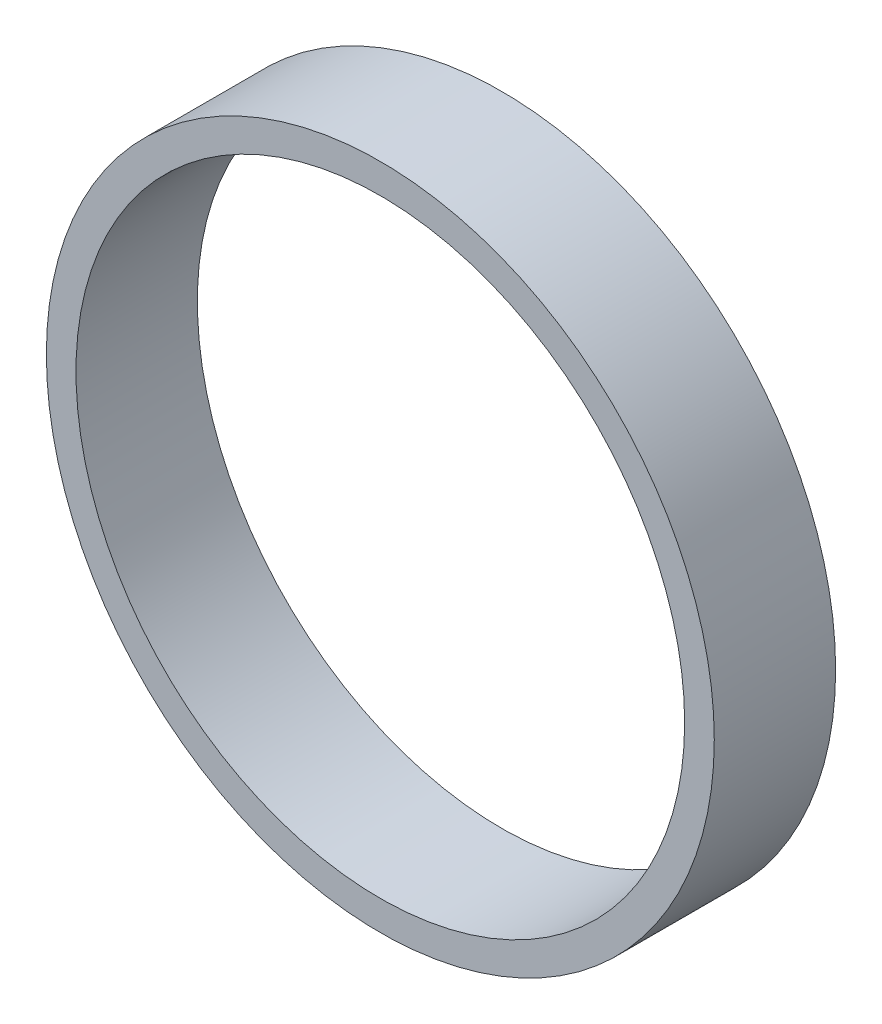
ISO-10303-21;
HEADER;
FILE_DESCRIPTION(('STEP AP214'),'2;1');
FILE_NAME('part.step','',(''),(''),'','','');
FILE_SCHEMA(('AUTOMOTIVE_DESIGN { 1 0 10303 214 1 1 1 1 }'));
ENDSEC;
DATA;
#1=APPLICATION_CONTEXT('core data for automotive mechanical design processes');
#2=APPLICATION_PROTOCOL_DEFINITION('international standard','automotive_design',2000,#1);
#3=PRODUCT_CONTEXT('',#1,'mechanical');
#4=PRODUCT('Part','Part','',(#3));
#5=PRODUCT_RELATED_PRODUCT_CATEGORY('part','',(#4));
#6=PRODUCT_DEFINITION_FORMATION('','',#4);
#7=PRODUCT_DEFINITION_CONTEXT('part definition',#1,'design');
#8=PRODUCT_DEFINITION('design','',#6,#7);
#9=PRODUCT_DEFINITION_SHAPE('','',#8);
#10=(LENGTH_UNIT() NAMED_UNIT(*) SI_UNIT(.MILLI.,.METRE.));
#11=(NAMED_UNIT(*) PLANE_ANGLE_UNIT() SI_UNIT($,.RADIAN.));
#12=(NAMED_UNIT(*) SI_UNIT($,.STERADIAN.) SOLID_ANGLE_UNIT());
#13=UNCERTAINTY_MEASURE_WITH_UNIT(LENGTH_MEASURE(1.E-05),#10,'distance_accuracy_value','');
#14=(GEOMETRIC_REPRESENTATION_CONTEXT(3) GLOBAL_UNCERTAINTY_ASSIGNED_CONTEXT((#13)) GLOBAL_UNIT_ASSIGNED_CONTEXT((#10,
#11,#12)) REPRESENTATION_CONTEXT('',''));
#15=CARTESIAN_POINT('',(0.,0.,0.));
#16=DIRECTION('',(0.,0.,1.));
#17=DIRECTION('',(1.,0.,0.));
#18=AXIS2_PLACEMENT_3D('',#15,#16,#17);
#19=CARTESIAN_POINT('',(0.,0.,12.7));
#20=DIRECTION('',(0.,0.,1.));
#21=DIRECTION('',(1.,0.,0.));
#22=AXIS2_PLACEMENT_3D('',#19,#20,#21);
#23=PLANE('',#22);
#24=CARTESIAN_POINT('',(0.,0.,12.7));
#25=DIRECTION('',(0.,0.,1.));
#26=DIRECTION('',(1.,0.,0.));
#27=AXIS2_PLACEMENT_3D('',#24,#25,#26);
#28=CIRCLE('',#27,34.95);
#29=CARTESIAN_POINT('',(34.95,0.,12.7));
#30=VERTEX_POINT('',#29);
#31=EDGE_CURVE('E8',#30,#30,#28,.T.);
#32=ORIENTED_EDGE('',*,*,#31,.T.);
#33=EDGE_LOOP('',(#32));
#34=FACE_BOUND('',#33,.T.);
#35=CARTESIAN_POINT('',(0.,0.,12.7));
#36=DIRECTION('',(0.,0.,1.));
#37=DIRECTION('',(1.,0.,0.));
#38=AXIS2_PLACEMENT_3D('',#35,#36,#37);
#39=CIRCLE('',#38,31.85);
#40=CARTESIAN_POINT('',(31.85,0.,12.7));
#41=VERTEX_POINT('',#40);
#42=EDGE_CURVE('E23',#41,#41,#39,.T.);
#43=ORIENTED_EDGE('',*,*,#42,.F.);
#44=EDGE_LOOP('',(#43));
#45=FACE_BOUND('',#44,.T.);
#46=ADVANCED_FACE('F12',(#34,#45),#23,.T.);
#47=CARTESIAN_POINT('',(0.,0.,0.));
#48=DIRECTION('',(0.,0.,1.));
#49=DIRECTION('',(1.,0.,0.));
#50=AXIS2_PLACEMENT_3D('',#47,#48,#49);
#51=PLANE('',#50);
#52=CARTESIAN_POINT('',(0.,0.,0.));
#53=DIRECTION('',(0.,0.,1.));
#54=DIRECTION('',(1.,0.,0.));
#55=AXIS2_PLACEMENT_3D('',#52,#53,#54);
#56=CIRCLE('',#55,34.95);
#57=CARTESIAN_POINT('',(34.95,0.,0.));
#58=VERTEX_POINT('',#57);
#59=EDGE_CURVE('E16',#58,#58,#56,.T.);
#60=ORIENTED_EDGE('',*,*,#59,.F.);
#61=EDGE_LOOP('',(#60));
#62=FACE_BOUND('',#61,.T.);
#63=CARTESIAN_POINT('',(0.,0.,0.));
#64=DIRECTION('',(0.,0.,1.));
#65=DIRECTION('',(1.,0.,0.));
#66=AXIS2_PLACEMENT_3D('',#63,#64,#65);
#67=CIRCLE('',#66,31.85);
#68=CARTESIAN_POINT('',(31.85,0.,0.));
#69=VERTEX_POINT('',#68);
#70=EDGE_CURVE('E25',#69,#69,#67,.T.);
#71=ORIENTED_EDGE('',*,*,#70,.T.);
#72=EDGE_LOOP('',(#71));
#73=FACE_BOUND('',#72,.T.);
#74=ADVANCED_FACE('F35',(#62,#73),#51,.F.);
#75=CARTESIAN_POINT('',(0.,0.,12.7));
#76=DIRECTION('',(0.,0.,-1.));
#77=DIRECTION('',(-1.,0.,0.));
#78=AXIS2_PLACEMENT_3D('',#75,#76,#77);
#79=CYLINDRICAL_SURFACE('',#78,34.95);
#80=ORIENTED_EDGE('',*,*,#31,.F.);
#81=EDGE_LOOP('',(#80));
#82=FACE_BOUND('',#81,.T.);
#83=ORIENTED_EDGE('',*,*,#59,.T.);
#84=EDGE_LOOP('',(#83));
#85=FACE_BOUND('',#84,.T.);
#86=ADVANCED_FACE('F14',(#82,#85),#79,.T.);
#87=CARTESIAN_POINT('',(0.,0.,12.7));
#88=DIRECTION('',(0.,0.,-1.));
#89=DIRECTION('',(-1.,0.,0.));
#90=AXIS2_PLACEMENT_3D('',#87,#88,#89);
#91=CYLINDRICAL_SURFACE('',#90,31.85);
#92=ORIENTED_EDGE('',*,*,#42,.T.);
#93=EDGE_LOOP('',(#92));
#94=FACE_BOUND('',#93,.T.);
#95=ORIENTED_EDGE('',*,*,#70,.F.);
#96=EDGE_LOOP('',(#95));
#97=FACE_BOUND('',#96,.T.);
#98=ADVANCED_FACE('F31',(#94,#97),#91,.F.);
#99=CLOSED_SHELL('',(#46,#74,#86,#98));
#100=MANIFOLD_SOLID_BREP('B1',#99);
#101=ADVANCED_BREP_SHAPE_REPRESENTATION('',(#18,#100),#14);
#102=SHAPE_DEFINITION_REPRESENTATION(#9,#101);
ENDSEC;
END-ISO-10303-21;
